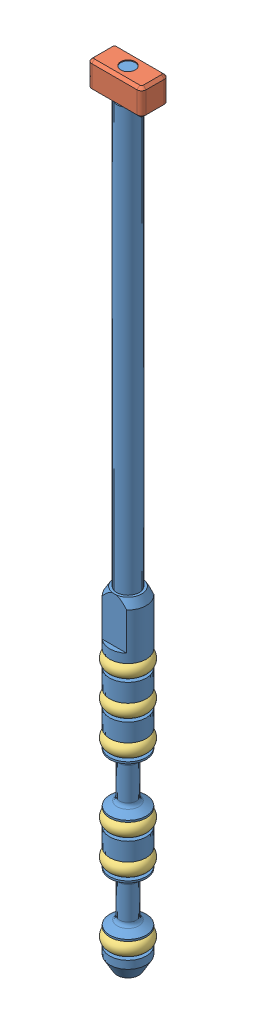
SolidWorks assembly LnG5_valve.SLDASM, configuration Default (file format 12000). Lengths in mm.
Overall size (139.5 99.6 14.01).
8 component instances, 3 part files, 2 mates.
Components (placement in the parent):
- LnG5_valve-1: LnG5_valve.SLDPRT [Default] at origin size (139.5 99.6 14.01)
- LnG5_valve_cap-1: LnG5_valve_cap.SLDPRT [Default] at origin size (139.5 99.6 14.01)
- comp_o-ring-003-5: comp_o-ring-003.SLDPRT [Default] at (56 -85.7 1.65) size (4.47 1.52 4.47)
- comp_o-ring-003-6: comp_o-ring-003.SLDPRT [Default] at (56 -78.1 1.65) size (4.47 1.52 4.47)
- comp_o-ring-003-7: comp_o-ring-003.SLDPRT [Default] at (56 -74.3 1.65) size (4.47 1.52 4.47)
- comp_o-ring-003-8: comp_o-ring-003.SLDPRT [Default] at (56 -66.7 1.65) size (4.47 1.52 4.47)
- comp_o-ring-003-9: comp_o-ring-003.SLDPRT [Default] at (56 -62.9 1.65) size (4.47 1.52 4.47)
- comp_o-ring-003-10: comp_o-ring-003.SLDPRT [Default] at (56 -59.1 1.65) size (4.47 1.52 4.47)
Mates (geometry in assembly coordinates):
- Concentric2: concentric aligned: cylinder of LnG5_valve-1 through (56 -1065.4575 1.65) axis (0 -1 0) radius 0.82; line of comp_o-ring_1x2-5 through (56 -30.7 1.65) axis (0 -1 0)
- Symmetric2: symmetric aligned: plane of LnG5_valve-1 through (56.82 -86.6 1.65) normal (0 1 0); plane of LnG5_valve-1 through (58.02 -84.8 1.65) normal (0 -1 0); plane of comp_o-ring_1x2-5 through (56 -85.7 1.65) normal (0 1 0)
